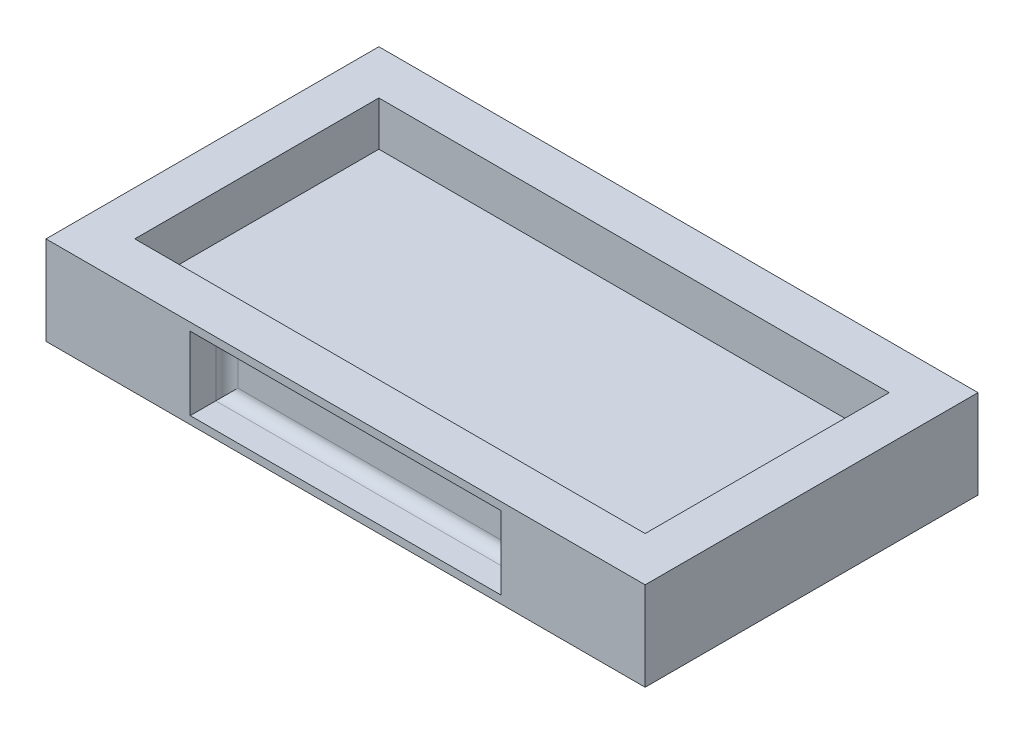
from build123d import *

# Parameters (mm, degrees)
SKETCH1_W           = 270
SKETCH1_H           = 40
BOSS_EXTRUDE1_DEPTH = 150
SHELL1_T            = -20
SKETCH2_W           = 140
SKETCH2_H           = 32.951507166
CUT_EXTRUDE2_DEPTH  = 16.5
FILLET2_R           = 5


with BuildPart() as part:
    # Sketch1 → Boss-Extrude1 (new body)
    with BuildSketch(Plane.XY):
        Rectangle(SKETCH1_W, SKETCH1_H)
    extrude(amount=BOSS_EXTRUDE1_DEPTH)

    # Shell1
    shell1_openings = [part.faces().sort_by_distance(p)[0] for p in [
        (0, 20, 75),
    ]]
    offset(amount=SHELL1_T, openings=shell1_openings, kind=Kind.INTERSECTION)

    # Sketch2 → Cut-Extrude2 (cut)
    with BuildSketch(Plane.XY.offset(150)):
        Rectangle(SKETCH2_W, SKETCH2_H)
    extrude(amount=-CUT_EXTRUDE2_DEPTH, mode=Mode.SUBTRACT)

    # Fillet2
    fillet2_edges = [part.edges().sort_by_distance(p)[0] for p in [
        (70, 0, 133.5),
        (0, -16.475753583, 133.5),
        (-70, 0, 133.5),
        (0, 16.475753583, 133.5),
    ]]
    fillet(fillet2_edges, radius=FILLET2_R)


solid = part.part
